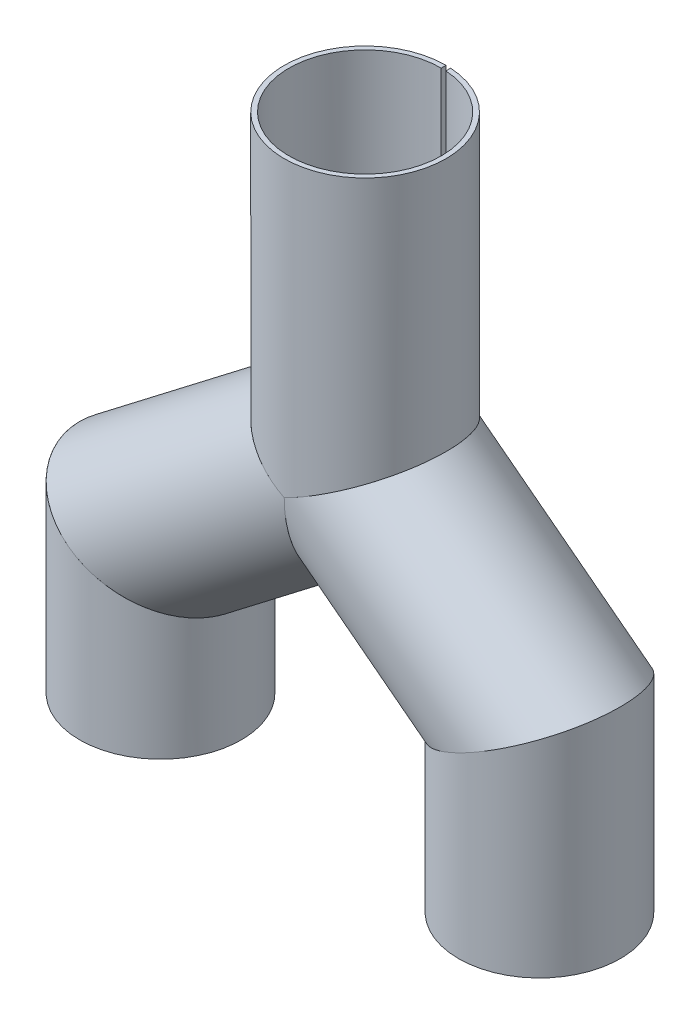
from build123d import *

# Parameters (mm, degrees)
SKETCH_2_R               = 16.977180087
SKETCH_2_R_2             = 15.977180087
EXTRUDE_1_DEPTH          = 61.615297
EXTRUDE_2_DEPTH          = 8.370753
EXTRUDE_2_DEPTH_BACK     = 46.121884
SKETCH_3_R               = 16.977180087
SKETCH_3_R_2             = 15.977180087
SKETCH_4_R               = 16.977180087
SKETCH_4_R_2             = 15.977180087
EXTRUDE_3_DEPTH          = 45.7781
EXTRUDE_4_DEPTH          = 54.127628
EXTRUDE_4_DEPTH_BACK     = 8.370753
SKETCH_5_R               = 16.977180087
SKETCH_5_R_2             = 15.977180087
SKETCH_6_R               = 16.977180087
SKETCH_6_R_2             = 15.977180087
EXTRUDE_5_DEPTH          = 40.90363
CUT_EXTRUDE_1_DEPTH      = 91.371007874
CUT_EXTRUDE_1_DEPTH_BACK = 91.371007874
CUT_EXTRUDE_2_DEPTH      = 91.371007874
CUT_EXTRUDE_2_DEPTH_BACK = 91.371007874
CUT_EXTRUDE_3_DEPTH      = 91.371007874
CUT_EXTRUDE_3_DEPTH_BACK = 91.371007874
CUT_EXTRUDE_6_DEPTH      = 91.371007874
CUT_EXTRUDE_6_DEPTH_BACK = 91.371007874
CUT_EXTRUDE_5_DEPTH      = 91.371007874
CUT_EXTRUDE_5_DEPTH_BACK = 91.371007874
SKETCH_8_2_OUTSIDE_W     = 150.227
SKETCH_8_2_OUTSIDE_H     = 163.853
CUT_EXTRUDE_1_2_DEPTH    = 91.371007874
SKETCH_1_W               = 1
SKETCH_1_H               = 61.615296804
CUT_EXTRUDE_2_2_DEPTH    = 91.371007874


with BuildPart() as part:
    # Sketch 2 → Extrude 1 (new body)
    with BuildSketch(Plane(origin=(0, 0, 0), x_dir=(1, 0, 0), z_dir=(0, 1, 0))):
        Circle(SKETCH_2_R)
        Circle(SKETCH_2_R_2, mode=Mode.SUBTRACT)
    extrude(amount=EXTRUDE_1_DEPTH)

    # Sketch 7 → Cut-Extrude 1 (cut, two sides: drawn at the far end of the back side and taken through both)
    with BuildSketch(Plane.XY.offset(-CUT_EXTRUDE_1_DEPTH_BACK)):
        Polygon((-33.954360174, 16.741506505), (0, 0), (33.954360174, 16.741506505), (33.954360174, -19.711551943), (-33.954360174, -19.711551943), align=None)
    extrude(amount=CUT_EXTRUDE_1_DEPTH + CUT_EXTRUDE_1_DEPTH_BACK, mode=Mode.SUBTRACT)

    # Sketch 1 → Cut-Extrude 2 2 (cut, through all)
    with BuildSketch(Plane.XY):
        with Locations((0.5, 30.807648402)):
            Rectangle(SKETCH_1_W, SKETCH_1_H)
    extrude(amount=-CUT_EXTRUDE_2_2_DEPTH, mode=Mode.SUBTRACT)


with BuildPart() as body_2:
    # Sketch 3 → Extrude 2 (new, two sides: drawn at the far end of the back side and taken through both)
    with BuildSketch(Plane(origin=(36.587051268, -28.082305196, 0), x_dir=(0, 0, -1), z_dir=(0.7932687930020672, -0.6088715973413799, 0)).offset(-EXTRUDE_2_DEPTH_BACK)):
        Circle(SKETCH_3_R)
        Circle(SKETCH_3_R_2, mode=Mode.SUBTRACT)
    extrude(amount=EXTRUDE_2_DEPTH + EXTRUDE_2_DEPTH_BACK)


with BuildPart() as body_3:
    # Sketch 4 → Extrude 3 (new body)
    with BuildSketch(Plane(origin=(0, -65.489652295, 0), x_dir=(-1, 0, 0), z_dir=(0, 1, 0))):
        with Locations((-36.587051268, 0)):
            Circle(SKETCH_4_R)
        with Locations((-36.587051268, 0)):
            Circle(SKETCH_4_R_2, mode=Mode.SUBTRACT)
    extrude(amount=EXTRUDE_3_DEPTH)


with BuildPart() as body_4:
    # Sketch 5 → Extrude 4 (new, two sides: drawn at the far end of the back side and taken through both)
    with BuildSketch(Plane(origin=(-42.937758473, -32.956775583, 0), x_dir=(0, 0, -1), z_dir=(0.7932687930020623, 0.6088715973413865, 0)).offset(-EXTRUDE_4_DEPTH_BACK)):
        Circle(SKETCH_5_R)
        Circle(SKETCH_5_R_2, mode=Mode.SUBTRACT)
    extrude(amount=EXTRUDE_4_DEPTH + EXTRUDE_4_DEPTH_BACK)


with BuildPart() as body_5:
    # Sketch 6 → Extrude 5 (new body)
    with BuildSketch(Plane(origin=(0, -65.489652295, 0), x_dir=(-1, 0, 0), z_dir=(0, 1, 0))):
        with Locations((42.937758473, 0)):
            Circle(SKETCH_6_R)
        with Locations((42.937758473, 0)):
            Circle(SKETCH_6_R_2, mode=Mode.SUBTRACT)
    extrude(amount=EXTRUDE_5_DEPTH)


with BuildPart() as cut_extrude_2_tool:
    # Sketch 8 → Cut-Extrude 2 (new, two sides: drawn at the far end of the back side and taken through both)
    with BuildSketch(Plane.XY.offset(-CUT_EXTRUDE_2_DEPTH_BACK)):
        Polygon((-59.91493856, -24.586022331), (-25.960578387, -41.327528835), (-25.960578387, -65.489652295), (19.609871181, -65.489652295), (19.609871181, -36.453058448), (53.564231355, -19.711551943), (53.564231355, -66.489652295), (-59.91493856, -66.489652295), align=None)
    extrude(amount=CUT_EXTRUDE_2_DEPTH + CUT_EXTRUDE_2_DEPTH_BACK)


with BuildPart() as body_4_1:
    add(body_4.part)

    # Cut-Extrude 2: cut by cut_extrude_2_tool
    add(cut_extrude_2_tool.part, mode=Mode.SUBTRACT)

    # Sketch 9 → Cut-Extrude 3 (cut, two sides: drawn at the far end of the back side and taken through both)
    with BuildSketch(Plane.XY.offset(-CUT_EXTRUDE_3_DEPTH_BACK)):
        Polygon((-16.977180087, 8.370753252), (-16.977180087, 61.615296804), (16.977180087, 61.615296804), (16.977180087, -65.489652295), (0, -65.489652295), (0, 0), align=None)
    extrude(amount=CUT_EXTRUDE_3_DEPTH + CUT_EXTRUDE_3_DEPTH_BACK, mode=Mode.SUBTRACT)


with BuildPart() as body_2_1:
    add(body_2.part)

    # Cut-Extrude 2: cut by cut_extrude_2_tool
    add(cut_extrude_2_tool.part, mode=Mode.SUBTRACT)

    # Sketch 10 → Cut-Extrude 6 (cut, two sides: drawn at the far end of the back side and taken through both)
    with BuildSketch(Plane.XY.offset(-CUT_EXTRUDE_6_DEPTH_BACK)):
        Polygon((16.977180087, 8.370753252), (16.977180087, 61.615296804), (-16.977180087, 61.615296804), (-16.977180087, -65.489652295), (0, -65.489652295), (0, 0), align=None)
    extrude(amount=CUT_EXTRUDE_6_DEPTH + CUT_EXTRUDE_6_DEPTH_BACK, mode=Mode.SUBTRACT)


with BuildPart() as cut_extrude_5_tool:
    # Sketch 8_2 outside → Cut-Extrude 5 (new, two sides: drawn at the far end of the back side and taken through both)
    with BuildSketch(Plane.XY.offset(-CUT_EXTRUDE_5_DEPTH_BACK)):
        with Locations((-3.1755, -1.9375)):
            Rectangle(SKETCH_8_2_OUTSIDE_W, SKETCH_8_2_OUTSIDE_H)
        Polygon((-59.91493856, -24.586022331), (-25.960578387, -41.327528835), (-25.960578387, -65.489652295), (19.609871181, -65.489652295), (19.609871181, -36.453058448), (53.564231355, -19.711551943), (53.564231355, -66.489652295), (-59.91493856, -66.489652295), align=None, mode=Mode.SUBTRACT)
    extrude(amount=CUT_EXTRUDE_5_DEPTH + CUT_EXTRUDE_5_DEPTH_BACK)


with BuildPart() as body_5_1:
    add(body_5.part)

    # Cut-Extrude 5: cut by cut_extrude_5_tool
    add(cut_extrude_5_tool.part, mode=Mode.SUBTRACT)


with BuildPart() as body_3_1:
    add(body_3.part)

    # Cut-Extrude 5: cut by cut_extrude_5_tool
    add(cut_extrude_5_tool.part, mode=Mode.SUBTRACT)


with BuildPart() as cut_extrude_1_2_tool:
    # Sketch 11 → Cut-Extrude 1 2 (new, through all)
    with BuildSketch(Plane.XY):
        Polygon((-42.437758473, -65.489652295), (-42.437758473, -33.203305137), (0, -0.630303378), (36.087051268, -28.328834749), (36.087051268, -65.489652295), (37.087051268, -65.489652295), (37.087051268, -27.835775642), (0, 0.630303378), (-43.437758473, -32.71024603), (-43.437758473, -65.489652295), align=None)
    extrude(amount=-CUT_EXTRUDE_1_2_DEPTH)


with BuildPart() as body_5_2:
    add(body_5_1.part)

    # Cut-Extrude 1 2: cut by cut_extrude_1_2_tool
    add(cut_extrude_1_2_tool.part, mode=Mode.SUBTRACT)


with BuildPart() as body_2_2:
    add(body_2_1.part)

    # Cut-Extrude 1 2: cut by cut_extrude_1_2_tool
    add(cut_extrude_1_2_tool.part, mode=Mode.SUBTRACT)


with BuildPart() as body_3_2:
    add(body_3_1.part)

    # Cut-Extrude 1 2: cut by cut_extrude_1_2_tool
    add(cut_extrude_1_2_tool.part, mode=Mode.SUBTRACT)


solid = Compound([part.part, body_4_1.part, body_5_2.part, body_2_2.part, body_3_2.part])
